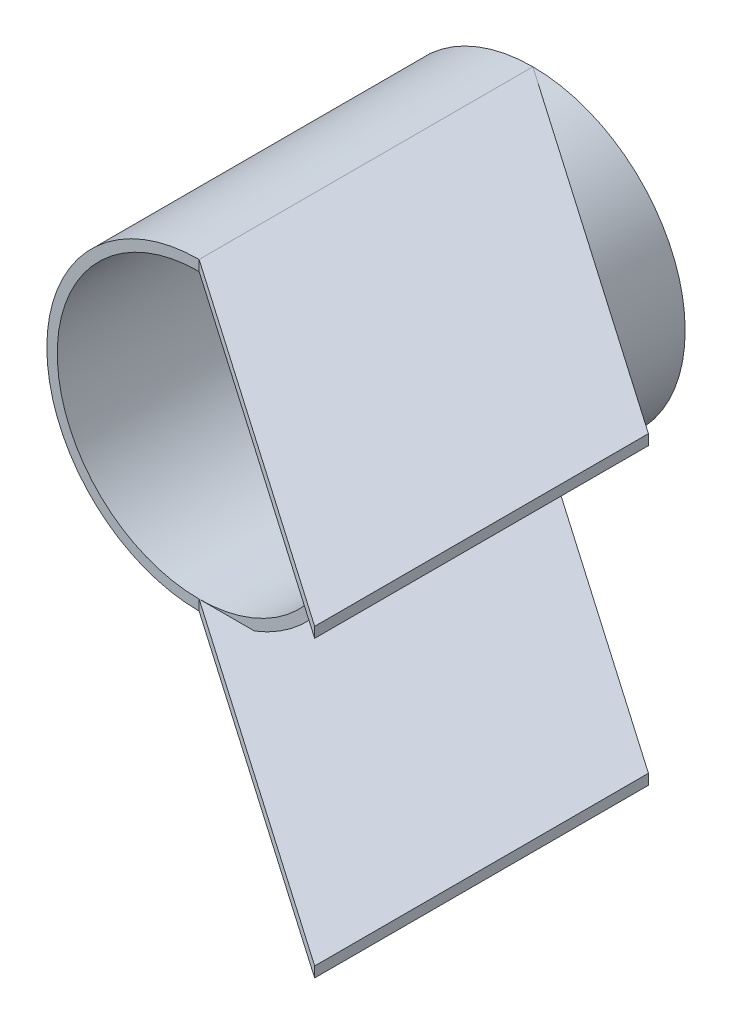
from build123d import *
from build123d.topology import SkipClean

# Parameters (mm, degrees)
SKETCH1_R                  = 46.355
SKETCH1_R_2                = 43.18
BOSS_EXTRUDE1_DEPTH        = 101.6
BOSS_EXTRUDE2_DEPTH        = 3.175
BOSS_EXTRUDE3_DEPTH        = 38.1
MT_FLANGE_DEPTH            = 314.78125191
CUT_OFF_FLANGES_DEPTH      = 300.49737389
CUT_OFF_FLANGES_DEPTH_BACK = 300.49737389
SKETCH6_W                  = 83.080939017
SKETCH6_H                  = 162.491635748


with BuildPart() as part:
    # Sketch1 → Boss-Extrude1 (new body)
    with BuildSketch(Plane.XY):
        Circle(SKETCH1_R)
        Circle(SKETCH1_R_2, mode=Mode.SUBTRACT)
    extrude(amount=BOSS_EXTRUDE1_DEPTH)

    # Sketch3 → Boss-Extrude2 (add)
    with SkipClean():  # the faces are left unmerged after this step: merging them gives an invalid solid
        with BuildSketch(Plane(origin=(0, 43.18, 0), x_dir=(1, 0, 0), z_dir=(0, 1, 0))):
            Polygon((0, 0), (0, -101.6), (165.1, -215.9), (165.1, -114.3), align=None)
        boss_extrude2 = extrude(amount=BOSS_EXTRUDE2_DEPTH)

    # Mirror1: Boss-Extrude2 across plane
    add(boss_extrude2.mirror(Plane.ZX))

    # Sketch4 → Boss-Extrude3 (add)
    with BuildSketch(Plane(origin=(0, 46.355, 0), x_dir=(1, 0, 0), z_dir=(0, 1, 0))):
        Polygon((165.1, -114.3), (161.925, -112.101923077), (161.925, -213.701923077), (165.1, -215.9), align=None)
    boss_extrude3 = extrude(amount=BOSS_EXTRUDE3_DEPTH)

    # Sketch5 → mt flange (cut, through all)
    with BuildSketch(Plane(origin=(165.1, 0, 0), x_dir=(0, 0, -1), z_dir=(1, 0, 0))):
        Polygon((-215.9, 40.71263066), (-196.85, 84.455), (-215.9, 84.455), align=None)
        Polygon((-112.128733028, 46.441942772), (-139.7, 84.455), (-112.128733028, 84.455), align=None)
    mt_flange = extrude(amount=-MT_FLANGE_DEPTH, mode=Mode.SUBTRACT)

    # Mirror2: Boss-Extrude3 across plane
    add(boss_extrude3.mirror(Plane.ZX))

    # Mirror3: mt flange across plane
    add(mt_flange.mirror(Plane.ZX), mode=Mode.SUBTRACT)

    # Sketch6 → cut off flanges (cut, two sides: drawn at the far end of the back side and taken through both)
    with BuildSketch(Plane(origin=(0, 43.18, 0), x_dir=(1, 0, 0), z_dir=(0, 1, 0)).offset(-CUT_OFF_FLANGES_DEPTH_BACK)):
        with Locations((155.840469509, -144.203286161)):
            Rectangle(SKETCH6_W, SKETCH6_H)
    extrude(amount=CUT_OFF_FLANGES_DEPTH + CUT_OFF_FLANGES_DEPTH_BACK, mode=Mode.SUBTRACT)


solid = part.part
